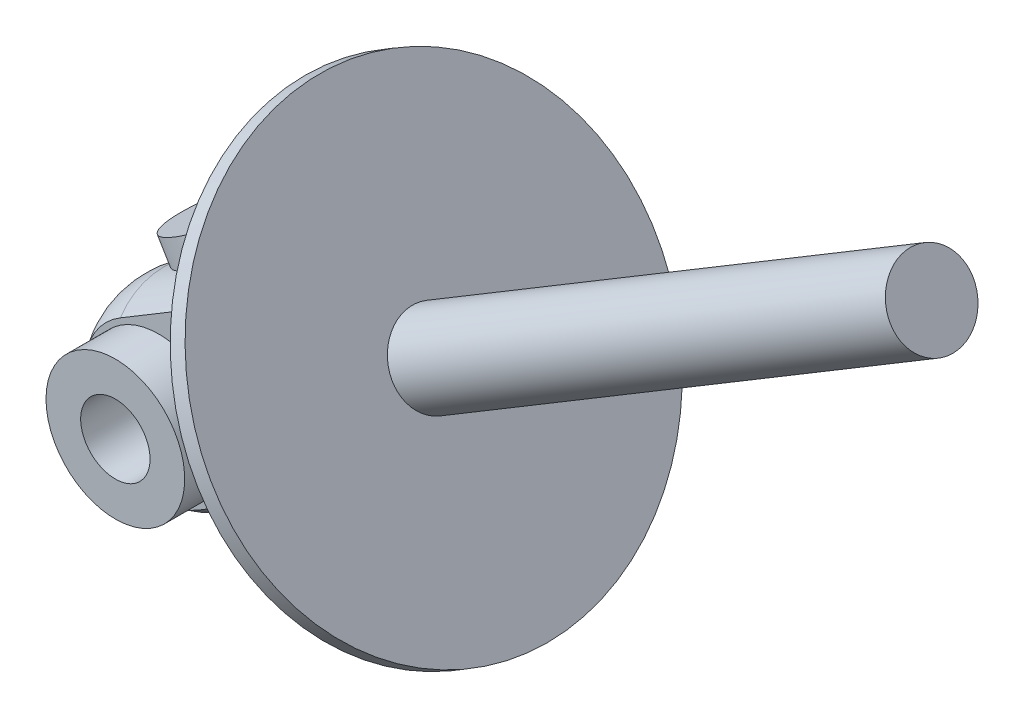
ISO-10303-21;
HEADER;
FILE_DESCRIPTION(('STEP AP214'),'2;1');
FILE_NAME('part.step','',(''),(''),'','','');
FILE_SCHEMA(('AUTOMOTIVE_DESIGN { 1 0 10303 214 1 1 1 1 }'));
ENDSEC;
DATA;
#1=APPLICATION_CONTEXT('core data for automotive mechanical design processes');
#2=APPLICATION_PROTOCOL_DEFINITION('international standard','automotive_design',2000,#1);
#3=PRODUCT_CONTEXT('',#1,'mechanical');
#4=PRODUCT('Part','Part','',(#3));
#5=PRODUCT_RELATED_PRODUCT_CATEGORY('part','',(#4));
#6=PRODUCT_DEFINITION_FORMATION('','',#4);
#7=PRODUCT_DEFINITION_CONTEXT('part definition',#1,'design');
#8=PRODUCT_DEFINITION('design','',#6,#7);
#9=PRODUCT_DEFINITION_SHAPE('','',#8);
#10=(LENGTH_UNIT() NAMED_UNIT(*) SI_UNIT(.MILLI.,.METRE.));
#11=(NAMED_UNIT(*) PLANE_ANGLE_UNIT() SI_UNIT($,.RADIAN.));
#12=(NAMED_UNIT(*) SI_UNIT($,.STERADIAN.) SOLID_ANGLE_UNIT());
#13=UNCERTAINTY_MEASURE_WITH_UNIT(LENGTH_MEASURE(1.E-05),#10,'distance_accuracy_value','');
#14=(GEOMETRIC_REPRESENTATION_CONTEXT(3) GLOBAL_UNCERTAINTY_ASSIGNED_CONTEXT((#13)) GLOBAL_UNIT_ASSIGNED_CONTEXT((#10,
#11,#12)) REPRESENTATION_CONTEXT('',''));
#15=CARTESIAN_POINT('',(0.,0.,0.));
#16=DIRECTION('',(0.,0.,1.));
#17=DIRECTION('',(1.,0.,0.));
#18=AXIS2_PLACEMENT_3D('',#15,#16,#17);
#19=CARTESIAN_POINT('',(-3.45335231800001,223.379804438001,-25.806));
#20=DIRECTION('',(-0.857318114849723,-0.514786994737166,0.));
#21=DIRECTION('',(0.,0.,0.999999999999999));
#22=AXIS2_PLACEMENT_3D('',#19,#20,#21);
#23=PLANE('',#22);
#24=CARTESIAN_POINT('',(-16.7379455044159,245.503755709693,0.));
#25=DIRECTION('',(-0.857318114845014,-0.514786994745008,0.));
#26=DIRECTION('',(0.514786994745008,-0.857318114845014,0.));
#27=AXIS2_PLACEMENT_3D('',#24,#25,#26);
#28=CIRCLE('',#27,25.5);
#29=CARTESIAN_POINT('',(-3.61087713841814,223.642143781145,0.));
#30=VERTEX_POINT('',#29);
#31=EDGE_CURVE('E42',#30,#30,#28,.T.);
#32=ORIENTED_EDGE('',*,*,#31,.F.);
#33=EDGE_LOOP('',(#32));
#34=FACE_BOUND('',#33,.T.);
#35=CARTESIAN_POINT('',(-16.7379455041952,245.503755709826,0.));
#36=DIRECTION('',(-0.857318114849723,-0.514786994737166,0.));
#37=DIRECTION('',(0.514786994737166,-0.857318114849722,0.));
#38=AXIS2_PLACEMENT_3D('',#35,#36,#37);
#39=CIRCLE('',#38,4.75);
#40=CARTESIAN_POINT('',(-14.2927072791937,241.431494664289,0.));
#41=VERTEX_POINT('',#40);
#42=EDGE_CURVE('E11',#41,#41,#39,.F.);
#43=ORIENTED_EDGE('',*,*,#42,.F.);
#44=EDGE_LOOP('',(#43));
#45=FACE_BOUND('',#44,.T.);
#46=ADVANCED_FACE('F34',(#34,#45),#23,.F.);
#47=CARTESIAN_POINT('',(-35.543159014,251.708361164,6.07199999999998));
#48=DIRECTION('',(-0.514786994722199,0.85731811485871,0.));
#49=DIRECTION('',(0.,0.,-0.999999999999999));
#50=AXIS2_PLACEMENT_3D('',#47,#48,#49);
#51=PLANE('',#50);
#52=CARTESIAN_POINT('',(-40.7487946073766,248.582574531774,0.));
#53=DIRECTION('',(-0.514786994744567,0.857318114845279,0.));
#54=DIRECTION('',(-0.857318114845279,-0.514786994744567,0.));
#55=AXIS2_PLACEMENT_3D('',#52,#53,#54);
#56=CIRCLE('',#55,6.);
#57=CARTESIAN_POINT('',(-45.8927032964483,245.493852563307,0.));
#58=VERTEX_POINT('',#57);
#59=EDGE_CURVE('E237',#58,#58,#56,.T.);
#60=ORIENTED_EDGE('',*,*,#59,.T.);
#61=EDGE_LOOP('',(#60));
#62=FACE_BOUND('',#61,.T.);
#63=ADVANCED_FACE('F166',(#62),#51,.T.);
#64=CARTESIAN_POINT('',(-42.4574889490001,230.060145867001,-11.));
#65=DIRECTION('',(0.,0.,0.999999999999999));
#66=DIRECTION('',(1.,0.,0.));
#67=AXIS2_PLACEMENT_3D('',#64,#65,#66);
#68=CYLINDRICAL_SURFACE('',#67,4.0000000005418);
#69=CARTESIAN_POINT('',(-42.4574889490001,230.060145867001,11.));
#70=DIRECTION('',(0.,0.,0.999999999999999));
#71=DIRECTION('',(1.,0.,0.));
#72=AXIS2_PLACEMENT_3D('',#69,#70,#71);
#73=CIRCLE('',#72,4.0000000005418);
#74=CARTESIAN_POINT('',(-38.4574889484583,230.060145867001,11.));
#75=VERTEX_POINT('',#74);
#76=EDGE_CURVE('E239',#75,#75,#73,.F.);
#77=CARTESIAN_POINT('',(-42.4574889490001,230.060145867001,-11.));
#78=DIRECTION('',(0.,0.,0.999999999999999));
#79=DIRECTION('',(1.,0.,0.));
#80=AXIS2_PLACEMENT_3D('',#77,#78,#79);
#81=CIRCLE('',#80,4.0000000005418);
#82=CARTESIAN_POINT('',(-38.4574889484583,230.060145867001,-11.));
#83=VERTEX_POINT('',#82);
#84=EDGE_CURVE('E234',#83,#83,#81,.T.);
#85=CARTESIAN_POINT('',(-38.4574889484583,230.060145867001,11.));
#86=CARTESIAN_POINT('',(-38.4574889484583,230.060145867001,10.7708333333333));
#87=CARTESIAN_POINT('',(-38.4574889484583,230.060145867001,10.5416666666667));
#88=CARTESIAN_POINT('',(-38.4574889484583,230.060145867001,10.0833333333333));
#89=CARTESIAN_POINT('',(-38.4574889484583,230.060145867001,9.85416666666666));
#90=CARTESIAN_POINT('',(-38.4574889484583,230.060145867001,9.39583333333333));
#91=CARTESIAN_POINT('',(-38.4574889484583,230.060145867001,9.16666666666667));
#92=CARTESIAN_POINT('',(-38.4574889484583,230.060145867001,8.70833333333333));
#93=CARTESIAN_POINT('',(-38.4574889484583,230.060145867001,8.47916666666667));
#94=CARTESIAN_POINT('',(-38.4574889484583,230.060145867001,8.02083333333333));
#95=CARTESIAN_POINT('',(-38.4574889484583,230.060145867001,7.79166666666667));
#96=CARTESIAN_POINT('',(-38.4574889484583,230.060145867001,7.33333333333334));
#97=CARTESIAN_POINT('',(-38.4574889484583,230.060145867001,7.10416666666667));
#98=CARTESIAN_POINT('',(-38.4574889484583,230.060145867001,6.64583333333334));
#99=CARTESIAN_POINT('',(-38.4574889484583,230.060145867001,6.41666666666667));
#100=CARTESIAN_POINT('',(-38.4574889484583,230.060145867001,5.95833333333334));
#101=CARTESIAN_POINT('',(-38.4574889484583,230.060145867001,5.72916666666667));
#102=CARTESIAN_POINT('',(-38.4574889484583,230.060145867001,5.27083333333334));
#103=CARTESIAN_POINT('',(-38.4574889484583,230.060145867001,5.04166666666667));
#104=CARTESIAN_POINT('',(-38.4574889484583,230.060145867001,4.58333333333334));
#105=CARTESIAN_POINT('',(-38.4574889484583,230.060145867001,4.35416666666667));
#106=CARTESIAN_POINT('',(-38.4574889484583,230.060145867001,3.89583333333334));
#107=CARTESIAN_POINT('',(-38.4574889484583,230.060145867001,3.66666666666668));
#108=CARTESIAN_POINT('',(-38.4574889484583,230.060145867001,3.20833333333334));
#109=CARTESIAN_POINT('',(-38.4574889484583,230.060145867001,2.97916666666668));
#110=CARTESIAN_POINT('',(-38.4574889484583,230.060145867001,2.52083333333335));
#111=CARTESIAN_POINT('',(-38.4574889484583,230.060145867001,2.29166666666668));
#112=CARTESIAN_POINT('',(-38.4574889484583,230.060145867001,1.83333333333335));
#113=CARTESIAN_POINT('',(-38.4574889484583,230.060145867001,1.60416666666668));
#114=CARTESIAN_POINT('',(-38.4574889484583,230.060145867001,1.14583333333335));
#115=CARTESIAN_POINT('',(-38.4574889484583,230.060145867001,0.916666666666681));
#116=CARTESIAN_POINT('',(-38.4574889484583,230.060145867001,0.458333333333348));
#117=CARTESIAN_POINT('',(-38.4574889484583,230.060145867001,0.229166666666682));
#118=CARTESIAN_POINT('',(-38.4574889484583,230.060145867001,-0.229166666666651));
#119=CARTESIAN_POINT('',(-38.4574889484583,230.060145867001,-0.458333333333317));
#120=CARTESIAN_POINT('',(-38.4574889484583,230.060145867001,-0.91666666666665));
#121=CARTESIAN_POINT('',(-38.4574889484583,230.060145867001,-1.14583333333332));
#122=CARTESIAN_POINT('',(-38.4574889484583,230.060145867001,-1.60416666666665));
#123=CARTESIAN_POINT('',(-38.4574889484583,230.060145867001,-1.83333333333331));
#124=CARTESIAN_POINT('',(-38.4574889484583,230.060145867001,-2.29166666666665));
#125=CARTESIAN_POINT('',(-38.4574889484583,230.060145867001,-2.52083333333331));
#126=CARTESIAN_POINT('',(-38.4574889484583,230.060145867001,-2.97916666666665));
#127=CARTESIAN_POINT('',(-38.4574889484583,230.060145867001,-3.20833333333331));
#128=CARTESIAN_POINT('',(-38.4574889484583,230.060145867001,-3.66666666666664));
#129=CARTESIAN_POINT('',(-38.4574889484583,230.060145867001,-3.89583333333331));
#130=CARTESIAN_POINT('',(-38.4574889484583,230.060145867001,-4.35416666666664));
#131=CARTESIAN_POINT('',(-38.4574889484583,230.060145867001,-4.58333333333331));
#132=CARTESIAN_POINT('',(-38.4574889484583,230.060145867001,-5.04166666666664));
#133=CARTESIAN_POINT('',(-38.4574889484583,230.060145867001,-5.27083333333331));
#134=CARTESIAN_POINT('',(-38.4574889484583,230.060145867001,-5.72916666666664));
#135=CARTESIAN_POINT('',(-38.4574889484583,230.060145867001,-5.95833333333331));
#136=CARTESIAN_POINT('',(-38.4574889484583,230.060145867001,-6.41666666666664));
#137=CARTESIAN_POINT('',(-38.4574889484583,230.060145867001,-6.64583333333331));
#138=CARTESIAN_POINT('',(-38.4574889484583,230.060145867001,-7.10416666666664));
#139=CARTESIAN_POINT('',(-38.4574889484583,230.060145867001,-7.33333333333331));
#140=CARTESIAN_POINT('',(-38.4574889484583,230.060145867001,-7.79166666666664));
#141=CARTESIAN_POINT('',(-38.4574889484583,230.060145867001,-8.0208333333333));
#142=CARTESIAN_POINT('',(-38.4574889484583,230.060145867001,-8.47916666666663));
#143=CARTESIAN_POINT('',(-38.4574889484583,230.060145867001,-8.7083333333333));
#144=CARTESIAN_POINT('',(-38.4574889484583,230.060145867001,-9.16666666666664));
#145=CARTESIAN_POINT('',(-38.4574889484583,230.060145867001,-9.3958333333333));
#146=CARTESIAN_POINT('',(-38.4574889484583,230.060145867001,-9.85416666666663));
#147=CARTESIAN_POINT('',(-38.4574889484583,230.060145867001,-10.0833333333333));
#148=CARTESIAN_POINT('',(-38.4574889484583,230.060145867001,-10.5416666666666));
#149=CARTESIAN_POINT('',(-38.4574889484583,230.060145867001,-10.7708333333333));
#150=CARTESIAN_POINT('',(-38.4574889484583,230.060145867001,-11.));
#151=B_SPLINE_CURVE_WITH_KNOTS('',3,(#85,#86,#87,#88,#89,#90,#91,#92,#93,#94,#95,#96,#97,#98,
#99,#100,#101,#102,#103,#104,#105,#106,#107,#108,#109,#110,#111,#112,#113,#114,#115,#116,#117,
#118,#119,#120,#121,#122,#123,#124,#125,#126,#127,#128,#129,#130,#131,#132,#133,#134,#135,#136,
#137,#138,#139,#140,#141,#142,#143,#144,#145,#146,#147,#148,#149,#150),.UNSPECIFIED.,.F.,.F.,(4,
2,2,2,2,2,2,2,2,2,2,2,2,2,2,2,2,2,2,2,2,2,2,2,2,2,2,2,2,2,2,2,4),(0.,0.687500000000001,1.375,
2.06249999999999,2.75,3.43749999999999,4.12499999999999,4.81249999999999,5.49999999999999,
6.18749999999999,6.87499999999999,7.56249999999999,8.24999999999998,8.93749999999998,
9.62499999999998,10.3125,11.,11.6875,12.375,13.0625,13.75,14.4375,15.125,15.8125,16.5,17.1875,
17.875,18.5625,19.25,19.9375,20.625,21.3125,22.),.UNSPECIFIED.);
#152=EDGE_CURVE('BSEAM171',#75,#83,#151,.T.);
#153=ORIENTED_EDGE('',*,*,#76,.F.);
#154=ORIENTED_EDGE('',*,*,#84,.F.);
#155=ORIENTED_EDGE('',*,*,#152,.T.);
#156=ORIENTED_EDGE('',*,*,#152,.F.);
#157=EDGE_LOOP('',(#153,#155,#154,#156));
#158=FACE_BOUND('',#157,.T.);
#159=ADVANCED_FACE('F171',(#158),#68,.F.);
#160=CARTESIAN_POINT('',(-31.3489259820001,227.287013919,11.));
#161=DIRECTION('',(0.,0.,0.999999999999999));
#162=DIRECTION('',(-0.514786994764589,0.857318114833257,0.));
#163=AXIS2_PLACEMENT_3D('',#160,#161,#162);
#164=PLANE('',#163);
#165=ORIENTED_EDGE('',*,*,#76,.T.);
#166=EDGE_LOOP('',(#165));
#167=FACE_BOUND('',#166,.T.);
#168=CARTESIAN_POINT('',(-42.4574889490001,230.060145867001,11.));
#169=DIRECTION('',(0.,0.,-0.999999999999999));
#170=DIRECTION('',(-1.,0.,0.));
#171=AXIS2_PLACEMENT_3D('',#168,#169,#170);
#172=CIRCLE('',#171,7.99999999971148);
#173=CARTESIAN_POINT('',(-50.4574889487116,230.060145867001,11.));
#174=VERTEX_POINT('',#173);
#175=EDGE_CURVE('E231',#174,#174,#172,.F.);
#176=ORIENTED_EDGE('',*,*,#175,.T.);
#177=EDGE_LOOP('',(#176));
#178=FACE_BOUND('',#177,.T.);
#179=ADVANCED_FACE('F189',(#167,#178),#164,.T.);
#180=CARTESIAN_POINT('',(-39.2044336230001,246.010620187,0.));
#181=DIRECTION('',(-0.514786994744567,0.857318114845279,0.));
#182=DIRECTION('',(-0.857318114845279,-0.514786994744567,0.));
#183=AXIS2_PLACEMENT_3D('',#180,#181,#182);
#184=CYLINDRICAL_SURFACE('',#183,6.);
#185=ORIENTED_EDGE('',*,*,#59,.F.);
#186=EDGE_LOOP('',(#185));
#187=FACE_BOUND('',#186,.T.);
#188=CARTESIAN_POINT('',(-39.2044336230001,246.010620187,0.));
#189=DIRECTION('',(-0.514786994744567,0.857318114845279,0.));
#190=DIRECTION('',(-0.857318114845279,-0.514786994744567,0.));
#191=AXIS2_PLACEMENT_3D('',#188,#189,#190);
#192=CIRCLE('',#191,6.);
#193=CARTESIAN_POINT('',(-44.3483423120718,242.921898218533,0.));
#194=VERTEX_POINT('',#193);
#195=EDGE_CURVE('E228',#194,#194,#192,.T.);
#196=ORIENTED_EDGE('',*,*,#195,.T.);
#197=EDGE_LOOP('',(#196));
#198=FACE_BOUND('',#197,.T.);
#199=ADVANCED_FACE('F192',(#187,#198),#184,.T.);
#200=CARTESIAN_POINT('',(-45.2306208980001,218.951582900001,-11.));
#201=DIRECTION('',(0.,0.,-0.999999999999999));
#202=DIRECTION('',(-0.514786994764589,0.857318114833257,0.));
#203=AXIS2_PLACEMENT_3D('',#200,#201,#202);
#204=PLANE('',#203);
#205=ORIENTED_EDGE('',*,*,#84,.T.);
#206=EDGE_LOOP('',(#205));
#207=FACE_BOUND('',#206,.T.);
#208=CARTESIAN_POINT('',(-42.4574889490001,230.060145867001,-11.));
#209=DIRECTION('',(0.,0.,0.999999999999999));
#210=DIRECTION('',(1.,0.,0.));
#211=AXIS2_PLACEMENT_3D('',#208,#209,#210);
#212=CIRCLE('',#211,8.00000000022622);
#213=CARTESIAN_POINT('',(-34.4574889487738,230.060145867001,-11.));
#214=VERTEX_POINT('',#213);
#215=EDGE_CURVE('E144',#214,#214,#212,.F.);
#216=ORIENTED_EDGE('',*,*,#215,.T.);
#217=EDGE_LOOP('',(#216));
#218=FACE_BOUND('',#217,.T.);
#219=ADVANCED_FACE('F194',(#207,#218),#204,.T.);
#220=CARTESIAN_POINT('',(-42.4574889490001,230.060145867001,11.));
#221=DIRECTION('',(0.,0.,-0.999999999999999));
#222=DIRECTION('',(-1.,0.,0.));
#223=AXIS2_PLACEMENT_3D('',#220,#221,#222);
#224=CYLINDRICAL_SURFACE('',#223,7.99999999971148);
#225=CARTESIAN_POINT('',(-42.4574889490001,230.060145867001,5.99999999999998));
#226=DIRECTION('',(0.,0.,-0.999999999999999));
#227=DIRECTION('',(-1.,0.,0.));
#228=AXIS2_PLACEMENT_3D('',#225,#226,#227);
#229=CIRCLE('',#228,7.99999999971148);
#230=CARTESIAN_POINT('',(-50.4574889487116,230.060145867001,5.99999999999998));
#231=VERTEX_POINT('',#230);
#232=EDGE_CURVE('E143',#231,#231,#229,.T.);
#233=CARTESIAN_POINT('',(-50.4574889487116,230.060145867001,5.99999999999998));
#234=CARTESIAN_POINT('',(-50.4574889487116,230.060145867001,6.05208333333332));
#235=CARTESIAN_POINT('',(-50.4574889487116,230.060145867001,6.10416666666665));
#236=CARTESIAN_POINT('',(-50.4574889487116,230.060145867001,6.20833333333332));
#237=CARTESIAN_POINT('',(-50.4574889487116,230.060145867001,6.26041666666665));
#238=CARTESIAN_POINT('',(-50.4574889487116,230.060145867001,6.36458333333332));
#239=CARTESIAN_POINT('',(-50.4574889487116,230.060145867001,6.41666666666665));
#240=CARTESIAN_POINT('',(-50.4574889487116,230.060145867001,6.52083333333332));
#241=CARTESIAN_POINT('',(-50.4574889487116,230.060145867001,6.57291666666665));
#242=CARTESIAN_POINT('',(-50.4574889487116,230.060145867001,6.67708333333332));
#243=CARTESIAN_POINT('',(-50.4574889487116,230.060145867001,6.72916666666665));
#244=CARTESIAN_POINT('',(-50.4574889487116,230.060145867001,6.83333333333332));
#245=CARTESIAN_POINT('',(-50.4574889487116,230.060145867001,6.88541666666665));
#246=CARTESIAN_POINT('',(-50.4574889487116,230.060145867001,6.98958333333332));
#247=CARTESIAN_POINT('',(-50.4574889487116,230.060145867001,7.04166666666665));
#248=CARTESIAN_POINT('',(-50.4574889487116,230.060145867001,7.14583333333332));
#249=CARTESIAN_POINT('',(-50.4574889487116,230.060145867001,7.19791666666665));
#250=CARTESIAN_POINT('',(-50.4574889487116,230.060145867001,7.30208333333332));
#251=CARTESIAN_POINT('',(-50.4574889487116,230.060145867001,7.35416666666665));
#252=CARTESIAN_POINT('',(-50.4574889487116,230.060145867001,7.45833333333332));
#253=CARTESIAN_POINT('',(-50.4574889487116,230.060145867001,7.51041666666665));
#254=CARTESIAN_POINT('',(-50.4574889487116,230.060145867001,7.61458333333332));
#255=CARTESIAN_POINT('',(-50.4574889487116,230.060145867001,7.66666666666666));
#256=CARTESIAN_POINT('',(-50.4574889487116,230.060145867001,7.77083333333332));
#257=CARTESIAN_POINT('',(-50.4574889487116,230.060145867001,7.82291666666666));
#258=CARTESIAN_POINT('',(-50.4574889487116,230.060145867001,7.92708333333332));
#259=CARTESIAN_POINT('',(-50.4574889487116,230.060145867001,7.97916666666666));
#260=CARTESIAN_POINT('',(-50.4574889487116,230.060145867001,8.08333333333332));
#261=CARTESIAN_POINT('',(-50.4574889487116,230.060145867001,8.13541666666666));
#262=CARTESIAN_POINT('',(-50.4574889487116,230.060145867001,8.23958333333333));
#263=CARTESIAN_POINT('',(-50.4574889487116,230.060145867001,8.29166666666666));
#264=CARTESIAN_POINT('',(-50.4574889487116,230.060145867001,8.39583333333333));
#265=CARTESIAN_POINT('',(-50.4574889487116,230.060145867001,8.44791666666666));
#266=CARTESIAN_POINT('',(-50.4574889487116,230.060145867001,8.55208333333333));
#267=CARTESIAN_POINT('',(-50.4574889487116,230.060145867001,8.60416666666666));
#268=CARTESIAN_POINT('',(-50.4574889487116,230.060145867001,8.70833333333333));
#269=CARTESIAN_POINT('',(-50.4574889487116,230.060145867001,8.76041666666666));
#270=CARTESIAN_POINT('',(-50.4574889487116,230.060145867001,8.86458333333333));
#271=CARTESIAN_POINT('',(-50.4574889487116,230.060145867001,8.91666666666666));
#272=CARTESIAN_POINT('',(-50.4574889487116,230.060145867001,9.02083333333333));
#273=CARTESIAN_POINT('',(-50.4574889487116,230.060145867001,9.07291666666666));
#274=CARTESIAN_POINT('',(-50.4574889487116,230.060145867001,9.17708333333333));
#275=CARTESIAN_POINT('',(-50.4574889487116,230.060145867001,9.22916666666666));
#276=CARTESIAN_POINT('',(-50.4574889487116,230.060145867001,9.33333333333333));
#277=CARTESIAN_POINT('',(-50.4574889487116,230.060145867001,9.38541666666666));
#278=CARTESIAN_POINT('',(-50.4574889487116,230.060145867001,9.48958333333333));
#279=CARTESIAN_POINT('',(-50.4574889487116,230.060145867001,9.54166666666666));
#280=CARTESIAN_POINT('',(-50.4574889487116,230.060145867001,9.64583333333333));
#281=CARTESIAN_POINT('',(-50.4574889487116,230.060145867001,9.69791666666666));
#282=CARTESIAN_POINT('',(-50.4574889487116,230.060145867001,9.80208333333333));
#283=CARTESIAN_POINT('',(-50.4574889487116,230.060145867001,9.85416666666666));
#284=CARTESIAN_POINT('',(-50.4574889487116,230.060145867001,9.95833333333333));
#285=CARTESIAN_POINT('',(-50.4574889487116,230.060145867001,10.0104166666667));
#286=CARTESIAN_POINT('',(-50.4574889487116,230.060145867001,10.1145833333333));
#287=CARTESIAN_POINT('',(-50.4574889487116,230.060145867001,10.1666666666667));
#288=CARTESIAN_POINT('',(-50.4574889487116,230.060145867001,10.2708333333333));
#289=CARTESIAN_POINT('',(-50.4574889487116,230.060145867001,10.3229166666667));
#290=CARTESIAN_POINT('',(-50.4574889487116,230.060145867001,10.4270833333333));
#291=CARTESIAN_POINT('',(-50.4574889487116,230.060145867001,10.4791666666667));
#292=CARTESIAN_POINT('',(-50.4574889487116,230.060145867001,10.5833333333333));
#293=CARTESIAN_POINT('',(-50.4574889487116,230.060145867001,10.6354166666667));
#294=CARTESIAN_POINT('',(-50.4574889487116,230.060145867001,10.7395833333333));
#295=CARTESIAN_POINT('',(-50.4574889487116,230.060145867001,10.7916666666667));
#296=CARTESIAN_POINT('',(-50.4574889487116,230.060145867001,10.8958333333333));
#297=CARTESIAN_POINT('',(-50.4574889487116,230.060145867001,10.9479166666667));
#298=CARTESIAN_POINT('',(-50.4574889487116,230.060145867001,11.));
#299=B_SPLINE_CURVE_WITH_KNOTS('',3,(#233,#234,#235,#236,#237,#238,#239,#240,#241,#242,#243,
#244,#245,#246,#247,#248,#249,#250,#251,#252,#253,#254,#255,#256,#257,#258,#259,#260,#261,#262,
#263,#264,#265,#266,#267,#268,#269,#270,#271,#272,#273,#274,#275,#276,#277,#278,#279,#280,#281,
#282,#283,#284,#285,#286,#287,#288,#289,#290,#291,#292,#293,#294,#295,#296,#297,#298),
.UNSPECIFIED.,.F.,.F.,(4,2,2,2,2,2,2,2,2,2,2,2,2,2,2,2,2,2,2,2,2,2,2,2,2,2,2,2,2,2,2,2,4),(0.,
0.156250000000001,0.312500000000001,0.468750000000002,0.625000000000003,0.781250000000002,
0.937500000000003,1.09375,1.25,1.40625,1.56250000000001,1.71875000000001,1.87500000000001,
2.03125000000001,2.18750000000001,2.34375000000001,2.50000000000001,2.65625000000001,
2.81250000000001,2.96875000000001,3.12500000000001,3.28125000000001,3.43750000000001,
3.59375000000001,3.75000000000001,3.90625000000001,4.06250000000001,4.21875000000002,
4.37500000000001,4.53125000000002,4.68750000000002,4.84375000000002,5.00000000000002),.UNSPECIFIED.);
#300=EDGE_CURVE('BSEAM197',#231,#174,#299,.T.);
#301=ORIENTED_EDGE('',*,*,#232,.F.);
#302=ORIENTED_EDGE('',*,*,#175,.F.);
#303=ORIENTED_EDGE('',*,*,#300,.T.);
#304=ORIENTED_EDGE('',*,*,#300,.F.);
#305=EDGE_LOOP('',(#301,#303,#302,#304));
#306=FACE_BOUND('',#305,.T.);
#307=ADVANCED_FACE('F197',(#306),#224,.T.);
#308=CARTESIAN_POINT('',(-33.99879803,249.136406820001,6.07199999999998));
#309=DIRECTION('',(-0.514786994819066,0.857318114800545,0.));
#310=DIRECTION('',(0.,0.,-0.999999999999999));
#311=AXIS2_PLACEMENT_3D('',#308,#309,#310);
#312=PLANE('',#311);
#313=CARTESIAN_POINT('',(-39.2044336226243,246.010620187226,0.));
#314=DIRECTION('',(0.514786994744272,-0.857318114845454,0.));
#315=DIRECTION('',(0.857318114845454,0.514786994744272,0.));
#316=AXIS2_PLACEMENT_3D('',#313,#314,#315);
#317=CIRCLE('',#316,3.);
#318=CARTESIAN_POINT('',(-36.632479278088,247.554981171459,0.));
#319=VERTEX_POINT('',#318);
#320=EDGE_CURVE('E87',#319,#319,#317,.F.);
#321=ORIENTED_EDGE('',*,*,#320,.T.);
#322=EDGE_LOOP('',(#321));
#323=FACE_BOUND('',#322,.T.);
#324=ORIENTED_EDGE('',*,*,#195,.F.);
#325=EDGE_LOOP('',(#324));
#326=FACE_BOUND('',#325,.T.);
#327=ADVANCED_FACE('F199',(#323,#326),#312,.F.);
#328=CARTESIAN_POINT('',(-42.4574889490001,230.060145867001,-11.));
#329=DIRECTION('',(0.,0.,0.999999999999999));
#330=DIRECTION('',(1.,0.,0.));
#331=AXIS2_PLACEMENT_3D('',#328,#329,#330);
#332=CYLINDRICAL_SURFACE('',#331,8.00000000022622);
#333=CARTESIAN_POINT('',(-42.4574889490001,230.060145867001,-6.));
#334=DIRECTION('',(0.,0.,0.999999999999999));
#335=DIRECTION('',(1.,0.,0.));
#336=AXIS2_PLACEMENT_3D('',#333,#334,#335);
#337=CIRCLE('',#336,8.00000000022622);
#338=CARTESIAN_POINT('',(-34.4574889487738,230.060145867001,-6.));
#339=VERTEX_POINT('',#338);
#340=EDGE_CURVE('E86',#339,#339,#337,.T.);
#341=CARTESIAN_POINT('',(-34.4574889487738,230.060145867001,-6.));
#342=CARTESIAN_POINT('',(-34.4574889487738,230.060145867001,-6.05208333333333));
#343=CARTESIAN_POINT('',(-34.4574889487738,230.060145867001,-6.10416666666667));
#344=CARTESIAN_POINT('',(-34.4574889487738,230.060145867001,-6.20833333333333));
#345=CARTESIAN_POINT('',(-34.4574889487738,230.060145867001,-6.26041666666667));
#346=CARTESIAN_POINT('',(-34.4574889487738,230.060145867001,-6.36458333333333));
#347=CARTESIAN_POINT('',(-34.4574889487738,230.060145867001,-6.41666666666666));
#348=CARTESIAN_POINT('',(-34.4574889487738,230.060145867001,-6.52083333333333));
#349=CARTESIAN_POINT('',(-34.4574889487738,230.060145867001,-6.57291666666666));
#350=CARTESIAN_POINT('',(-34.4574889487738,230.060145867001,-6.67708333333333));
#351=CARTESIAN_POINT('',(-34.4574889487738,230.060145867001,-6.72916666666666));
#352=CARTESIAN_POINT('',(-34.4574889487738,230.060145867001,-6.83333333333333));
#353=CARTESIAN_POINT('',(-34.4574889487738,230.060145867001,-6.88541666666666));
#354=CARTESIAN_POINT('',(-34.4574889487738,230.060145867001,-6.98958333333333));
#355=CARTESIAN_POINT('',(-34.4574889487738,230.060145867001,-7.04166666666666));
#356=CARTESIAN_POINT('',(-34.4574889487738,230.060145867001,-7.14583333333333));
#357=CARTESIAN_POINT('',(-34.4574889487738,230.060145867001,-7.19791666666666));
#358=CARTESIAN_POINT('',(-34.4574889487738,230.060145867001,-7.30208333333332));
#359=CARTESIAN_POINT('',(-34.4574889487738,230.060145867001,-7.35416666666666));
#360=CARTESIAN_POINT('',(-34.4574889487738,230.060145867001,-7.45833333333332));
#361=CARTESIAN_POINT('',(-34.4574889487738,230.060145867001,-7.51041666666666));
#362=CARTESIAN_POINT('',(-34.4574889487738,230.060145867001,-7.61458333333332));
#363=CARTESIAN_POINT('',(-34.4574889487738,230.060145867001,-7.66666666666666));
#364=CARTESIAN_POINT('',(-34.4574889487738,230.060145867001,-7.77083333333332));
#365=CARTESIAN_POINT('',(-34.4574889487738,230.060145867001,-7.82291666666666));
#366=CARTESIAN_POINT('',(-34.4574889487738,230.060145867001,-7.92708333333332));
#367=CARTESIAN_POINT('',(-34.4574889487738,230.060145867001,-7.97916666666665));
#368=CARTESIAN_POINT('',(-34.4574889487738,230.060145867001,-8.08333333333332));
#369=CARTESIAN_POINT('',(-34.4574889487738,230.060145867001,-8.13541666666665));
#370=CARTESIAN_POINT('',(-34.4574889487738,230.060145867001,-8.23958333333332));
#371=CARTESIAN_POINT('',(-34.4574889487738,230.060145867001,-8.29166666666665));
#372=CARTESIAN_POINT('',(-34.4574889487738,230.060145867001,-8.39583333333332));
#373=CARTESIAN_POINT('',(-34.4574889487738,230.060145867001,-8.44791666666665));
#374=CARTESIAN_POINT('',(-34.4574889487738,230.060145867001,-8.55208333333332));
#375=CARTESIAN_POINT('',(-34.4574889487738,230.060145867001,-8.60416666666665));
#376=CARTESIAN_POINT('',(-34.4574889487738,230.060145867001,-8.70833333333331));
#377=CARTESIAN_POINT('',(-34.4574889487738,230.060145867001,-8.76041666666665));
#378=CARTESIAN_POINT('',(-34.4574889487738,230.060145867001,-8.86458333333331));
#379=CARTESIAN_POINT('',(-34.4574889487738,230.060145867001,-8.91666666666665));
#380=CARTESIAN_POINT('',(-34.4574889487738,230.060145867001,-9.02083333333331));
#381=CARTESIAN_POINT('',(-34.4574889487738,230.060145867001,-9.07291666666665));
#382=CARTESIAN_POINT('',(-34.4574889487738,230.060145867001,-9.17708333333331));
#383=CARTESIAN_POINT('',(-34.4574889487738,230.060145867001,-9.22916666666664));
#384=CARTESIAN_POINT('',(-34.4574889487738,230.060145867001,-9.33333333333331));
#385=CARTESIAN_POINT('',(-34.4574889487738,230.060145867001,-9.38541666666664));
#386=CARTESIAN_POINT('',(-34.4574889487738,230.060145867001,-9.48958333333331));
#387=CARTESIAN_POINT('',(-34.4574889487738,230.060145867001,-9.54166666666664));
#388=CARTESIAN_POINT('',(-34.4574889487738,230.060145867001,-9.64583333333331));
#389=CARTESIAN_POINT('',(-34.4574889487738,230.060145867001,-9.69791666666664));
#390=CARTESIAN_POINT('',(-34.4574889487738,230.060145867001,-9.80208333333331));
#391=CARTESIAN_POINT('',(-34.4574889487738,230.060145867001,-9.85416666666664));
#392=CARTESIAN_POINT('',(-34.4574889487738,230.060145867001,-9.95833333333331));
#393=CARTESIAN_POINT('',(-34.4574889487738,230.060145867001,-10.0104166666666));
#394=CARTESIAN_POINT('',(-34.4574889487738,230.060145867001,-10.1145833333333));
#395=CARTESIAN_POINT('',(-34.4574889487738,230.060145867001,-10.1666666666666));
#396=CARTESIAN_POINT('',(-34.4574889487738,230.060145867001,-10.2708333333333));
#397=CARTESIAN_POINT('',(-34.4574889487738,230.060145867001,-10.3229166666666));
#398=CARTESIAN_POINT('',(-34.4574889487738,230.060145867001,-10.4270833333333));
#399=CARTESIAN_POINT('',(-34.4574889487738,230.060145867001,-10.4791666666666));
#400=CARTESIAN_POINT('',(-34.4574889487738,230.060145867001,-10.5833333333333));
#401=CARTESIAN_POINT('',(-34.4574889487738,230.060145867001,-10.6354166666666));
#402=CARTESIAN_POINT('',(-34.4574889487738,230.060145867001,-10.7395833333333));
#403=CARTESIAN_POINT('',(-34.4574889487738,230.060145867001,-10.7916666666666));
#404=CARTESIAN_POINT('',(-34.4574889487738,230.060145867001,-10.8958333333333));
#405=CARTESIAN_POINT('',(-34.4574889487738,230.060145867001,-10.9479166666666));
#406=CARTESIAN_POINT('',(-34.4574889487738,230.060145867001,-11.));
#407=B_SPLINE_CURVE_WITH_KNOTS('',3,(#341,#342,#343,#344,#345,#346,#347,#348,#349,#350,#351,
#352,#353,#354,#355,#356,#357,#358,#359,#360,#361,#362,#363,#364,#365,#366,#367,#368,#369,#370,
#371,#372,#373,#374,#375,#376,#377,#378,#379,#380,#381,#382,#383,#384,#385,#386,#387,#388,#389,
#390,#391,#392,#393,#394,#395,#396,#397,#398,#399,#400,#401,#402,#403,#404,#405,#406),
.UNSPECIFIED.,.F.,.F.,(4,2,2,2,2,2,2,2,2,2,2,2,2,2,2,2,2,2,2,2,2,2,2,2,2,2,2,2,2,2,2,2,4),(0.,
0.156249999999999,0.312499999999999,0.468749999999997,0.624999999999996,0.781249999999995,
0.937499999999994,1.09374999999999,1.24999999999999,1.40624999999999,1.56249999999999,
1.71874999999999,1.87499999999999,2.03124999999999,2.18749999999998,2.34374999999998,
2.49999999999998,2.65624999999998,2.81249999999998,2.96874999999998,3.12499999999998,
3.28124999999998,3.43749999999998,3.59374999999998,3.74999999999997,3.90624999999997,
4.06249999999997,4.21874999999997,4.37499999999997,4.53124999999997,4.68749999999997,
4.84374999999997,4.99999999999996),.UNSPECIFIED.);
#408=EDGE_CURVE('BSEAM121',#339,#214,#407,.T.);
#409=ORIENTED_EDGE('',*,*,#340,.F.);
#410=ORIENTED_EDGE('',*,*,#215,.F.);
#411=ORIENTED_EDGE('',*,*,#408,.T.);
#412=ORIENTED_EDGE('',*,*,#408,.F.);
#413=EDGE_LOOP('',(#409,#411,#410,#412));
#414=FACE_BOUND('',#413,.T.);
#415=ADVANCED_FACE('F121',(#414),#332,.T.);
#416=CARTESIAN_POINT('',(-21.2507164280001,232.622467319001,5.99999999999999));
#417=DIRECTION('',(-0.85731811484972,-0.514786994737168,0.));
#418=DIRECTION('',(0.,0.,0.999999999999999));
#419=AXIS2_PLACEMENT_3D('',#416,#417,#418);
#420=PLANE('',#419);
#421=CARTESIAN_POINT('',(-25.7397857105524,240.098492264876,0.));
#422=DIRECTION('',(-0.857318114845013,-0.514786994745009,0.));
#423=DIRECTION('',(0.514786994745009,-0.857318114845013,0.));
#424=AXIS2_PLACEMENT_3D('',#421,#422,#423);
#425=CIRCLE('',#424,10.5000000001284);
#426=CARTESIAN_POINT('',(-21.3039464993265,232.711115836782,6.00000000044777));
#427=VERTEX_POINT('',#426);
#428=CARTESIAN_POINT('',(-30.1756249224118,247.485868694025,5.99999999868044));
#429=VERTEX_POINT('',#428);
#430=EDGE_CURVE('E73',#427,#429,#425,.T.);
#431=ORIENTED_EDGE('',*,*,#430,.T.);
#432=DIRECTION('',(-0.514786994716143,0.857318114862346,0.));
#433=VECTOR('',#432,1.);
#434=CARTESIAN_POINT('',(-25.7397857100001,240.098492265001,5.99999999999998));
#435=LINE('',#434,#433);
#436=EDGE_CURVE('E75',#427,#429,#435,.T.);
#437=ORIENTED_EDGE('',*,*,#436,.F.);
#438=EDGE_LOOP('',(#431,#437));
#439=FACE_BOUND('',#438,.T.);
#440=ADVANCED_FACE('F203',(#439),#420,.T.);
#441=CARTESIAN_POINT('',(-21.303946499,232.711115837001,5.99999999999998));
#442=DIRECTION('',(0.,0.,0.999999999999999));
#443=DIRECTION('',(-0.514786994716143,0.857318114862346,0.));
#444=AXIS2_PLACEMENT_3D('',#441,#442,#443);
#445=PLANE('',#444);
#446=ORIENTED_EDGE('',*,*,#232,.T.);
#447=EDGE_LOOP('',(#446));
#448=FACE_BOUND('',#447,.T.);
#449=ORIENTED_EDGE('',*,*,#436,.T.);
#450=DIRECTION('',(0.857318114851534,0.514786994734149,-8.82016681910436E-12));
#451=VECTOR('',#450,1.);
#452=CARTESIAN_POINT('',(-36.176851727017,243.882359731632,5.99999999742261));
#453=LINE('',#452,#451);
#454=CARTESIAN_POINT('',(-46.8933281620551,237.447522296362,5.99999999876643));
#455=VERTEX_POINT('',#454);
#456=EDGE_CURVE('E110',#429,#455,#453,.F.);
#457=ORIENTED_EDGE('',*,*,#456,.T.);
#458=CARTESIAN_POINT('',(-42.4574889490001,230.060145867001,5.99999999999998));
#459=DIRECTION('',(0.,0.,0.999999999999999));
#460=DIRECTION('',(1.,0.,0.));
#461=AXIS2_PLACEMENT_3D('',#458,#459,#460);
#462=CIRCLE('',#461,8.61684396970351);
#463=CARTESIAN_POINT('',(-38.0216497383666,222.672769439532,6.00000000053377));
#464=VERTEX_POINT('',#463);
#465=EDGE_CURVE('E217',#455,#464,#462,.T.);
#466=ORIENTED_EDGE('',*,*,#465,.T.);
#467=DIRECTION('',(-0.857318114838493,-0.514786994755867,8.81961170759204E-12));
#468=VECTOR('',#467,1.);
#469=CARTESIAN_POINT('',(-27.305173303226,229.107606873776,6.00000000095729));
#470=LINE('',#469,#468);
#471=EDGE_CURVE('E145',#464,#427,#470,.F.);
#472=ORIENTED_EDGE('',*,*,#471,.T.);
#473=EDGE_LOOP('',(#449,#457,#466,#472));
#474=FACE_BOUND('',#473,.T.);
#475=ADVANCED_FACE('F119',(#448,#474),#445,.T.);
#476=CARTESIAN_POINT('',(-39.2044336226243,246.010620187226,0.));
#477=DIRECTION('',(0.514786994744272,-0.857318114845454,0.));
#478=DIRECTION('',(0.857318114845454,0.514786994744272,0.));
#479=AXIS2_PLACEMENT_3D('',#476,#477,#478);
#480=CYLINDRICAL_SURFACE('',#479,3.);
#481=CARTESIAN_POINT('',(-35.8602987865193,246.269004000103,-2.58430325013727E-09));
#482=CARTESIAN_POINT('',(-35.8603024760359,246.268996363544,-0.164852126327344));
#483=CARTESIAN_POINT('',(-35.8699736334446,246.258619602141,-0.329793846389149));
#484=CARTESIAN_POINT('',(-35.9084855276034,246.217698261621,-0.654958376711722));
#485=CARTESIAN_POINT('',(-35.9373441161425,246.187134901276,-0.815176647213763));
#486=CARTESIAN_POINT('',(-36.0136335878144,246.107657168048,-1.12606460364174));
#487=CARTESIAN_POINT('',(-36.0610346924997,246.058772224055,-1.27674915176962));
#488=CARTESIAN_POINT('',(-36.1736257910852,245.945261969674,-1.56492250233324));
#489=CARTESIAN_POINT('',(-36.2388152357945,245.880637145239,-1.70241171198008));
#490=CARTESIAN_POINT('',(-36.3878072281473,245.737134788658,-1.96392803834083));
#491=CARTESIAN_POINT('',(-36.4720131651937,245.657956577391,-2.08756032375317));
#492=CARTESIAN_POINT('',(-36.6569791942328,245.490162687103,-2.31443623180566));
#493=CARTESIAN_POINT('',(-36.7577451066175,245.401543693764,-2.41767265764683));
#494=CARTESIAN_POINT('',(-36.9765659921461,245.216995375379,-2.60284246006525));
#495=CARTESIAN_POINT('',(-37.0949329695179,245.120953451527,-2.68429588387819));
#496=CARTESIAN_POINT('',(-37.3451055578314,244.927606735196,-2.82043359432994));
#497=CARTESIAN_POINT('',(-37.476894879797,244.830303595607,-2.87514987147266));
#498=CARTESIAN_POINT('',(-37.7085894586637,244.66811431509,-2.94355020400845));
#499=CARTESIAN_POINT('',(-37.8058280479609,244.602465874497,-2.96467932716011));
#500=CARTESIAN_POINT('',(-38.0039768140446,244.47374417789,-2.99290644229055));
#501=CARTESIAN_POINT('',(-38.1048867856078,244.410670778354,-3.00000521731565));
#502=CARTESIAN_POINT('',(-38.3481348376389,244.26462046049,-2.99999278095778));
#503=CARTESIAN_POINT('',(-38.4915129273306,244.183292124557,-2.98638439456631));
#504=CARTESIAN_POINT('',(-38.7781676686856,244.029657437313,-2.93240869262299));
#505=CARTESIAN_POINT('',(-38.921444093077,243.957359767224,-2.89201586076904));
#506=CARTESIAN_POINT('',(-39.2030053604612,243.823039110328,-2.78593629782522));
#507=CARTESIAN_POINT('',(-39.3412985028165,243.76099835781,-2.72029397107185));
#508=CARTESIAN_POINT('',(-39.6087799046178,243.647278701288,-2.56571351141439));
#509=CARTESIAN_POINT('',(-39.7379683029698,243.595599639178,-2.47677573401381));
#510=CARTESIAN_POINT('',(-39.9863765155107,243.501038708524,-2.27539780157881));
#511=CARTESIAN_POINT('',(-40.1052507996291,243.458419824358,-2.16240782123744));
#512=CARTESIAN_POINT('',(-40.3251145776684,243.383022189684,-1.9172825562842));
#513=CARTESIAN_POINT('',(-40.4260983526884,243.350246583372,-1.78514117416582));
#514=CARTESIAN_POINT('',(-40.6081397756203,243.293252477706,-1.50240344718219));
#515=CARTESIAN_POINT('',(-40.6887826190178,243.26920829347,-1.35150430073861));
#516=CARTESIAN_POINT('',(-40.8240993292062,243.229878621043,-1.0375365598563));
#517=CARTESIAN_POINT('',(-40.8788035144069,243.214582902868,-0.874482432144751));
#518=CARTESIAN_POINT('',(-40.9473914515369,243.195652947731,-0.59220700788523));
#519=CARTESIAN_POINT('',(-40.9686473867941,243.189881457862,-0.474866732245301));
#520=CARTESIAN_POINT('',(-40.9970581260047,243.182196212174,-0.238366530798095));
#521=CARTESIAN_POINT('',(-41.004213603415,243.180282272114,-0.119206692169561));
#522=CARTESIAN_POINT('',(-41.004199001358,243.180281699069,0.164852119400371));
#523=CARTESIAN_POINT('',(-40.9904943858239,243.18394120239,0.329793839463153));
#524=CARTESIAN_POINT('',(-40.9362740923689,243.198702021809,0.654958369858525));
#525=CARTESIAN_POINT('',(-40.895733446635,243.209810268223,0.815176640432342));
#526=CARTESIAN_POINT('',(-40.7897254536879,243.239795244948,1.12606459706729));
#527=CARTESIAN_POINT('',(-40.7242980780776,243.258659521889,1.27674914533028));
#528=CARTESIAN_POINT('',(-40.5711891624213,243.304692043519,1.56492249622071));
#529=CARTESIAN_POINT('',(-40.4835083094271,243.331860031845,1.70241170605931));
#530=CARTESIAN_POINT('',(-40.2868181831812,243.395926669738,1.96392803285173));
#531=CARTESIAN_POINT('',(-40.1773539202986,243.43304006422,2.08756031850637));
#532=CARTESIAN_POINT('',(-39.9423149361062,243.517443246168,2.31443622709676));
#533=CARTESIAN_POINT('',(-39.8167345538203,243.564736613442,2.41767265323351));
#534=CARTESIAN_POINT('',(-39.5509954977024,243.671148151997,2.60284245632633));
#535=CARTESIAN_POINT('',(-39.4105907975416,243.730488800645,2.68429588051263));
#536=CARTESIAN_POINT('',(-39.1223506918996,243.860438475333,2.82043359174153));
#537=CARTESIAN_POINT('',(-38.9745244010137,243.931033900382,2.87514986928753));
#538=CARTESIAN_POINT('',(-38.7224705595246,244.05931718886,2.9435502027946));
#539=CARTESIAN_POINT('',(-38.6188234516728,244.114292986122,2.96467932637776));
#540=CARTESIAN_POINT('',(-38.4120766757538,244.228695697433,2.9929064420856));
#541=CARTESIAN_POINT('',(-38.3089769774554,244.288122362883,3.00000521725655));
#542=CARTESIAN_POINT('',(-38.0657385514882,244.434188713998,2.9999927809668));
#543=CARTESIAN_POINT('',(-37.9265661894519,244.522521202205,2.98638439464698));
#544=CARTESIAN_POINT('',(-37.6562325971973,244.703336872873,2.93240869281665));
#545=CARTESIAN_POINT('',(-37.5250791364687,244.795823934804,2.89201586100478));
#546=CARTESIAN_POINT('',(-37.2741873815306,244.981221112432,2.78593629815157));
#547=CARTESIAN_POINT('',(-37.1544295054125,245.074130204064,2.72029397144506));
#548=CARTESIAN_POINT('',(-36.9283390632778,245.25678170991,2.56571351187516));
#549=CARTESIAN_POINT('',(-36.8220062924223,245.346524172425,2.47677573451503));
#550=CARTESIAN_POINT('',(-36.6217909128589,245.521344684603,2.27539780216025));
#551=CARTESIAN_POINT('',(-36.5283028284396,245.606241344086,2.16240782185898));
#552=CARTESIAN_POINT('',(-36.3584179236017,245.76487300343,1.91728255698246));
#553=CARTESIAN_POINT('',(-36.2820265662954,245.838604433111,1.78514117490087));
#554=CARTESIAN_POINT('',(-36.1461620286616,245.972500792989,1.50240344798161));
#555=CARTESIAN_POINT('',(-36.0870376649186,246.032381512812,1.35150430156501));
#556=CARTESIAN_POINT('',(-35.9887251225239,246.133337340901,1.03753656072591));
#557=CARTESIAN_POINT('',(-35.9495136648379,246.174434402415,0.874482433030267));
#558=CARTESIAN_POINT('',(-35.9005691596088,246.226078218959,0.592207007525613));
#559=CARTESIAN_POINT('',(-35.8854847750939,246.242127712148,0.47486673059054));
#560=CARTESIAN_POINT('',(-35.8653484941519,246.263593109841,0.238366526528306));
#561=CARTESIAN_POINT('',(-35.8602961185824,246.269009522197,0.119206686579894));
#562=CARTESIAN_POINT('',(-35.8602987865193,246.269004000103,-2.58430325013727E-09));
#563=B_SPLINE_CURVE_WITH_KNOTS('',3,(#481,#482,#483,#484,#485,#486,#487,#488,#489,#490,#491,
#492,#493,#494,#495,#496,#497,#498,#499,#500,#501,#502,#503,#504,#505,#506,#507,#508,#509,#510,
#511,#512,#513,#514,#515,#516,#517,#518,#519,#520,#521,#522,#523,#524,#525,#526,#527,#528,#529,
#530,#531,#532,#533,#534,#535,#536,#537,#538,#539,#540,#541,#542,#543,#544,#545,#546,#547,#548,
#549,#550,#551,#552,#553,#554,#555,#556,#557,#558,#559,#560,#561,#562),.UNSPECIFIED.,.T.,.F.,(4,
2,2,2,2,2,2,2,2,2,2,2,2,2,2,2,2,2,2,2,2,2,2,2,2,2,2,2,2,2,2,2,2,2,2,2,2,2,2,2,4),(0.,
0.49411232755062,0.98868501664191,1.48246668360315,1.97623310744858,2.48166602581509,
2.98727697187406,3.50325007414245,4.01860430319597,4.37538743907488,4.73215066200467,
5.22579814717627,5.71991658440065,6.21316999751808,6.70641588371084,7.21245704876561,
7.71865968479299,8.23447490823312,8.74968572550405,9.10700176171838,9.46430073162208,
9.95841305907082,10.4529857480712,10.9467674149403,11.440533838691,11.9459667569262,
12.4515777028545,12.9675508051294,13.4829050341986,13.8396881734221,14.1964513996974,
14.6900988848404,15.1842173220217,15.6774707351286,16.1707166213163,16.6767577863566,
17.1829604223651,17.6987756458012,18.2139864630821,18.5713025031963,18.9286014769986),.UNSPECIFIED.);
#564=CARTESIAN_POINT('',(-35.8602987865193,246.269004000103,-2.58430325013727E-09));
#565=VERTEX_POINT('',#564);
#566=EDGE_CURVE('E103',#565,#565,#563,.T.);
#567=ORIENTED_EDGE('',*,*,#566,.T.);
#568=EDGE_LOOP('',(#567));
#569=FACE_BOUND('',#568,.T.);
#570=ORIENTED_EDGE('',*,*,#320,.F.);
#571=EDGE_LOOP('',(#570));
#572=FACE_BOUND('',#571,.T.);
#573=ADVANCED_FACE('F115',(#569,#572),#480,.T.);
#574=CARTESIAN_POINT('',(-21.2507164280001,232.622467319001,-5.99999999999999));
#575=DIRECTION('',(0.85731811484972,0.514786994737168,0.));
#576=DIRECTION('',(0.,0.,-0.999999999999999));
#577=AXIS2_PLACEMENT_3D('',#574,#575,#576);
#578=PLANE('',#577);
#579=DIRECTION('',(0.514786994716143,-0.857318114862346,0.));
#580=VECTOR('',#579,1.);
#581=CARTESIAN_POINT('',(-25.7397857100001,240.098492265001,-6.));
#582=LINE('',#581,#580);
#583=CARTESIAN_POINT('',(-30.1756249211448,247.485868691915,-6.00000000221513));
#584=VERTEX_POINT('',#583);
#585=CARTESIAN_POINT('',(-21.3039464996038,232.711115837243,-6.00000000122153));
#586=VERTEX_POINT('',#585);
#587=EDGE_CURVE('E81',#584,#586,#582,.T.);
#588=ORIENTED_EDGE('',*,*,#587,.F.);
#589=CARTESIAN_POINT('',(-25.7397857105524,240.098492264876,0.));
#590=DIRECTION('',(-0.857318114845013,-0.514786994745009,0.));
#591=DIRECTION('',(0.514786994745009,-0.857318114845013,0.));
#592=AXIS2_PLACEMENT_3D('',#589,#590,#591);
#593=CIRCLE('',#592,10.5000000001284);
#594=EDGE_CURVE('E85',#584,#586,#593,.T.);
#595=ORIENTED_EDGE('',*,*,#594,.T.);
#596=EDGE_LOOP('',(#588,#595));
#597=FACE_BOUND('',#596,.T.);
#598=ADVANCED_FACE('F83',(#597),#578,.F.);
#599=CARTESIAN_POINT('',(-45.5536566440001,218.150085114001,-6.));
#600=DIRECTION('',(0.,0.,-0.999999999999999));
#601=DIRECTION('',(-0.514786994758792,0.857318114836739,0.));
#602=AXIS2_PLACEMENT_3D('',#599,#600,#601);
#603=PLANE('',#602);
#604=ORIENTED_EDGE('',*,*,#340,.T.);
#605=EDGE_LOOP('',(#604));
#606=FACE_BOUND('',#605,.T.);
#607=ORIENTED_EDGE('',*,*,#587,.T.);
#608=DIRECTION('',(0.857318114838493,0.514786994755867,8.82016681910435E-12));
#609=VECTOR('',#608,1.);
#610=CARTESIAN_POINT('',(-27.3051733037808,229.1076068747,-6.0000000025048));
#611=LINE('',#610,#609);
#612=CARTESIAN_POINT('',(-38.0216497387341,222.672769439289,-6.00000000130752));
#613=VERTEX_POINT('',#612);
#614=EDGE_CURVE('E50',#586,#613,#611,.F.);
#615=ORIENTED_EDGE('',*,*,#614,.T.);
#616=CARTESIAN_POINT('',(-42.4574889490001,230.060145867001,-6.));
#617=DIRECTION('',(0.,0.,0.999999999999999));
#618=DIRECTION('',(1.,0.,0.));
#619=AXIS2_PLACEMENT_3D('',#616,#617,#618);
#620=CIRCLE('',#619,8.61684397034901);
#621=CARTESIAN_POINT('',(-46.8933281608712,237.44752229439,-6.00000000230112));
#622=VERTEX_POINT('',#621);
#623=EDGE_CURVE('E91',#613,#622,#620,.F.);
#624=ORIENTED_EDGE('',*,*,#623,.T.);
#625=DIRECTION('',(-0.857318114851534,-0.514786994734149,-8.82016681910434E-12));
#626=VECTOR('',#625,1.);
#627=CARTESIAN_POINT('',(-36.176851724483,243.882359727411,-6.00000000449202));
#628=LINE('',#627,#626);
#629=EDGE_CURVE('E89',#622,#584,#628,.F.);
#630=ORIENTED_EDGE('',*,*,#629,.T.);
#631=EDGE_LOOP('',(#607,#615,#624,#630));
#632=FACE_BOUND('',#631,.T.);
#633=ADVANCED_FACE('F90',(#606,#632),#603,.T.);
#634=CARTESIAN_POINT('',(-42.4574889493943,230.06014586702,-4.63508342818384E-10));
#635=DIRECTION('',(0.,0.,0.999999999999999));
#636=DIRECTION('',(0.514786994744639,-0.857318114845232,0.));
#637=AXIS2_PLACEMENT_3D('',#634,#635,#636);
#638=SPHERICAL_SURFACE('',#637,10.5);
#639=CARTESIAN_POINT('',(-42.4574889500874,230.060145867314,0.));
#640=DIRECTION('',(-0.857318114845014,-0.514786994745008,0.));
#641=DIRECTION('',(0.514786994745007,-0.857318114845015,0.));
#642=AXIS2_PLACEMENT_3D('',#639,#640,#641);
#643=CIRCLE('',#642,10.5000000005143);
#644=EDGE_CURVE('E66',#455,#622,#643,.T.);
#645=ORIENTED_EDGE('',*,*,#644,.T.);
#646=ORIENTED_EDGE('',*,*,#623,.F.);
#647=CARTESIAN_POINT('',(-42.4574889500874,230.060145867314,0.));
#648=DIRECTION('',(-0.857318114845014,-0.514786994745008,0.));
#649=DIRECTION('',(0.514786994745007,-0.857318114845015,0.));
#650=AXIS2_PLACEMENT_3D('',#647,#648,#649);
#651=CIRCLE('',#650,10.5000000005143);
#652=EDGE_CURVE('E97',#613,#464,#651,.T.);
#653=ORIENTED_EDGE('',*,*,#652,.T.);
#654=ORIENTED_EDGE('',*,*,#465,.F.);
#655=EDGE_LOOP('',(#645,#646,#653,#654));
#656=FACE_BOUND('',#655,.T.);
#657=ADVANCED_FACE('F123',(#656),#638,.T.);
#658=CARTESIAN_POINT('',(-21.0245360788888,242.929820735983,0.));
#659=DIRECTION('',(-0.857318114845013,-0.514786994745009,0.));
#660=DIRECTION('',(0.514786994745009,-0.857318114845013,0.));
#661=AXIS2_PLACEMENT_3D('',#658,#659,#660);
#662=CYLINDRICAL_SURFACE('',#661,10.5000000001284);
#663=ORIENTED_EDGE('',*,*,#644,.F.);
#664=ORIENTED_EDGE('',*,*,#456,.F.);
#665=ORIENTED_EDGE('',*,*,#430,.F.);
#666=ORIENTED_EDGE('',*,*,#471,.F.);
#667=ORIENTED_EDGE('',*,*,#652,.F.);
#668=ORIENTED_EDGE('',*,*,#614,.F.);
#669=ORIENTED_EDGE('',*,*,#594,.F.);
#670=ORIENTED_EDGE('',*,*,#629,.F.);
#671=EDGE_LOOP('',(#663,#664,#665,#666,#667,#668,#669,#670));
#672=FACE_BOUND('',#671,.T.);
#673=CARTESIAN_POINT('',(-21.0245360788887,242.929820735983,0.));
#674=DIRECTION('',(-0.857318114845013,-0.514786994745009,0.));
#675=DIRECTION('',(0.514786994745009,-0.857318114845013,0.));
#676=AXIS2_PLACEMENT_3D('',#673,#674,#675);
#677=CIRCLE('',#676,10.5000000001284);
#678=CARTESIAN_POINT('',(-15.619272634,233.927980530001,0.));
#679=VERTEX_POINT('',#678);
#680=EDGE_CURVE('E101',#679,#679,#677,.T.);
#681=ORIENTED_EDGE('',*,*,#680,.T.);
#682=EDGE_LOOP('',(#681));
#683=FACE_BOUND('',#682,.T.);
#684=ORIENTED_EDGE('',*,*,#566,.F.);
#685=EDGE_LOOP('',(#684));
#686=FACE_BOUND('',#685,.T.);
#687=ADVANCED_FACE('F93',(#672,#683,#686),#662,.T.);
#688=CARTESIAN_POINT('',(-11.907658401,227.746716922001,17.71));
#689=DIRECTION('',(0.85731811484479,0.51478699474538,0.));
#690=DIRECTION('',(0.,0.,-0.999999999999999));
#691=AXIS2_PLACEMENT_3D('',#688,#689,#690);
#692=PLANE('',#691);
#693=ORIENTED_EDGE('',*,*,#680,.F.);
#694=EDGE_LOOP('',(#693));
#695=FACE_BOUND('',#694,.T.);
#696=CARTESIAN_POINT('',(-21.0245360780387,242.929820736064,0.));
#697=DIRECTION('',(0.857318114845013,0.514786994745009,0.));
#698=DIRECTION('',(-0.514786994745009,0.857318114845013,0.));
#699=AXIS2_PLACEMENT_3D('',#696,#697,#698);
#700=CIRCLE('',#699,17.4999999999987);
#701=CARTESIAN_POINT('',(-30.0333084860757,257.932887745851,0.));
#702=VERTEX_POINT('',#701);
#703=EDGE_CURVE('E134',#702,#702,#700,.F.);
#704=ORIENTED_EDGE('',*,*,#703,.T.);
#705=EDGE_LOOP('',(#704));
#706=FACE_BOUND('',#705,.T.);
#707=ADVANCED_FACE('F155',(#695,#706),#692,.F.);
#708=CARTESIAN_POINT('',(-21.0245360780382,242.929820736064,0.));
#709=DIRECTION('',(0.857318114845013,0.514786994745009,0.));
#710=DIRECTION('',(-0.514786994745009,0.857318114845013,0.));
#711=AXIS2_PLACEMENT_3D('',#708,#709,#710);
#712=CONICAL_SURFACE('',#711,17.5,1.21202565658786);
#713=CARTESIAN_POINT('',(-18.4525817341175,244.474181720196,0.));
#714=DIRECTION('',(-0.857318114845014,-0.514786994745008,0.));
#715=DIRECTION('',(4.60511258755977E-12,-7.66924650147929E-12,0.999999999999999));
#716=AXIS2_PLACEMENT_3D('',#713,#714,#715);
#717=CIRCLE('',#716,25.5);
#718=CARTESIAN_POINT('',(-18.452581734,244.47418172,25.5));
#719=VERTEX_POINT('',#718);
#720=EDGE_CURVE('E131',#719,#719,#717,.T.);
#721=ORIENTED_EDGE('',*,*,#720,.T.);
#722=EDGE_LOOP('',(#721));
#723=FACE_BOUND('',#722,.T.);
#724=ORIENTED_EDGE('',*,*,#703,.F.);
#725=EDGE_LOOP('',(#724));
#726=FACE_BOUND('',#725,.T.);
#727=ADVANCED_FACE('F157',(#723,#726),#712,.T.);
#728=CARTESIAN_POINT('',(-16.7379455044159,245.503755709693,0.));
#729=DIRECTION('',(-0.857318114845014,-0.514786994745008,0.));
#730=DIRECTION('',(0.514786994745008,-0.857318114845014,0.));
#731=AXIS2_PLACEMENT_3D('',#728,#729,#730);
#732=CYLINDRICAL_SURFACE('',#731,25.5);
#733=ORIENTED_EDGE('',*,*,#720,.F.);
#734=EDGE_LOOP('',(#733));
#735=FACE_BOUND('',#734,.T.);
#736=ORIENTED_EDGE('',*,*,#31,.T.);
#737=EDGE_LOOP('',(#736));
#738=FACE_BOUND('',#737,.T.);
#739=ADVANCED_FACE('F162',(#735,#738),#732,.T.);
#740=CARTESIAN_POINT('',(40.7023681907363,279.994484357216,0.));
#741=DIRECTION('',(-0.857318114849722,-0.514786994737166,0.));
#742=DIRECTION('',(0.514786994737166,-0.857318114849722,0.));
#743=AXIS2_PLACEMENT_3D('',#740,#741,#742);
#744=CYLINDRICAL_SURFACE('',#743,4.75);
#745=CARTESIAN_POINT('',(40.7023681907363,279.994484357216,0.));
#746=DIRECTION('',(0.857318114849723,0.514786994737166,0.));
#747=DIRECTION('',(-0.514786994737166,0.857318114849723,0.));
#748=AXIS2_PLACEMENT_3D('',#745,#746,#747);
#749=CIRCLE('',#748,4.75);
#750=CARTESIAN_POINT('',(38.2571299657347,284.066745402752,0.));
#751=VERTEX_POINT('',#750);
#752=EDGE_CURVE('E130',#751,#751,#749,.T.);
#753=ORIENTED_EDGE('',*,*,#752,.F.);
#754=EDGE_LOOP('',(#753));
#755=FACE_BOUND('',#754,.T.);
#756=ORIENTED_EDGE('',*,*,#42,.T.);
#757=EDGE_LOOP('',(#756));
#758=FACE_BOUND('',#757,.T.);
#759=ADVANCED_FACE('F174',(#755,#758),#744,.T.);
#760=CARTESIAN_POINT('',(40.7023681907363,279.994484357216,0.));
#761=DIRECTION('',(0.857318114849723,0.514786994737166,0.));
#762=DIRECTION('',(-0.514786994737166,0.857318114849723,0.));
#763=AXIS2_PLACEMENT_3D('',#760,#761,#762);
#764=PLANE('',#763);
#765=ORIENTED_EDGE('',*,*,#752,.T.);
#766=EDGE_LOOP('',(#765));
#767=FACE_BOUND('',#766,.T.);
#768=ADVANCED_FACE('F183',(#767),#764,.T.);
#769=CLOSED_SHELL('',(#46,#63,#159,#179,#199,#219,#307,#327,#415,#440,#475,#573,#598,#633,#657,
#687,#707,#727,#739,#759,#768));
#770=MANIFOLD_SOLID_BREP('B2',#769);
#771=ADVANCED_BREP_SHAPE_REPRESENTATION('',(#18,#770),#14);
#772=SHAPE_DEFINITION_REPRESENTATION(#9,#771);
ENDSEC;
END-ISO-10303-21;
